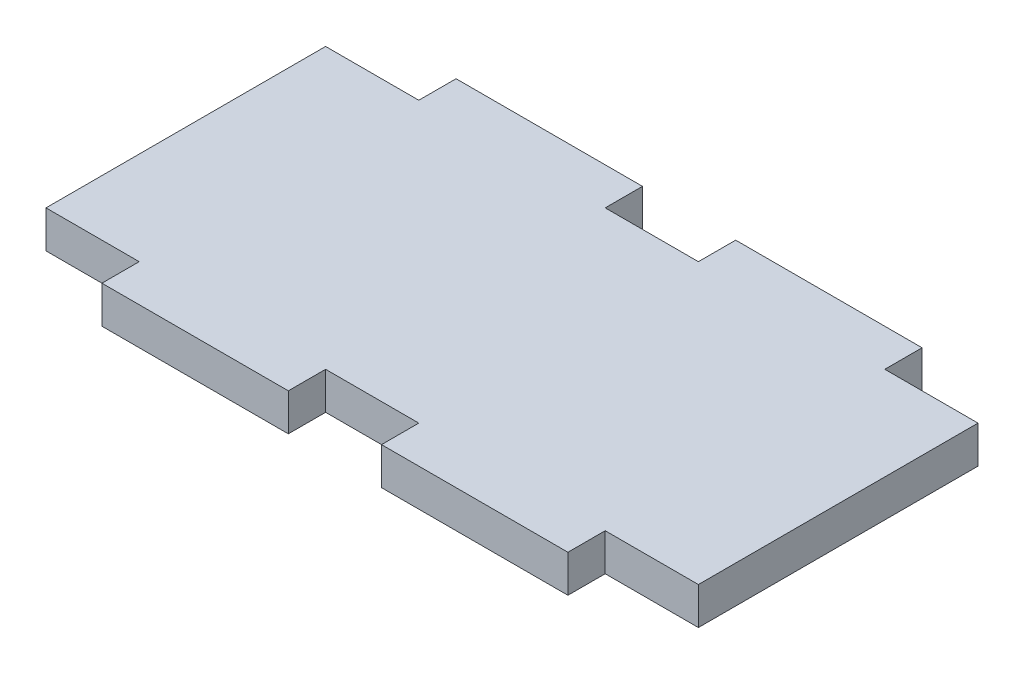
from build123d import *

# Parameters (mm, degrees)
SKETCH1_W           = 35
SKETCH1_H           = 15
BOSS_EXTRUDE1_DEPTH = 2
SKETCH2_W           = 10
SKETCH2_H           = 2
BOSS_EXTRUDE2_DEPTH = 2
LPATTERN1_COUNT     = 2
LPATTERN1_PITCH     = 15
SKETCH3_W           = 10
SKETCH3_H           = 2
BOSS_EXTRUDE3_DEPTH = 2


with BuildPart() as part:
    # Sketch1 → Boss-Extrude1 (new body)
    with BuildSketch(Plane(origin=(0, 0, 0), x_dir=(1, 0, 0), z_dir=(0, 1, 0))):
        with Locations((17.5, 7.5)):
            Rectangle(SKETCH1_W, SKETCH1_H)
    extrude(amount=BOSS_EXTRUDE1_DEPTH)

    # Sketch2 → Boss-Extrude2 (add)
    with BuildSketch(Plane.XY):
        with Locations((10, 1)):
            Rectangle(SKETCH2_W, SKETCH2_H)
    boss_extrude2 = extrude(amount=BOSS_EXTRUDE2_DEPTH)

    # LPattern1: Boss-Extrude2 ×2
    with Locations(*[(i * LPATTERN1_PITCH, 0, 0) for i in range(1, LPATTERN1_COUNT)]):
        add(boss_extrude2)

    # Sketch3 → Boss-Extrude3 (add)
    with BuildSketch(Plane(origin=(0, 0, -15), x_dir=(-1, 0, 0), z_dir=(0, 0, -1))):
        with Locations((-25, 1)):
            Rectangle(SKETCH3_W, SKETCH3_H)
        with Locations((-10, 1)):
            Rectangle(SKETCH3_W, SKETCH3_H)
    extrude(amount=BOSS_EXTRUDE3_DEPTH)


solid = part.part
